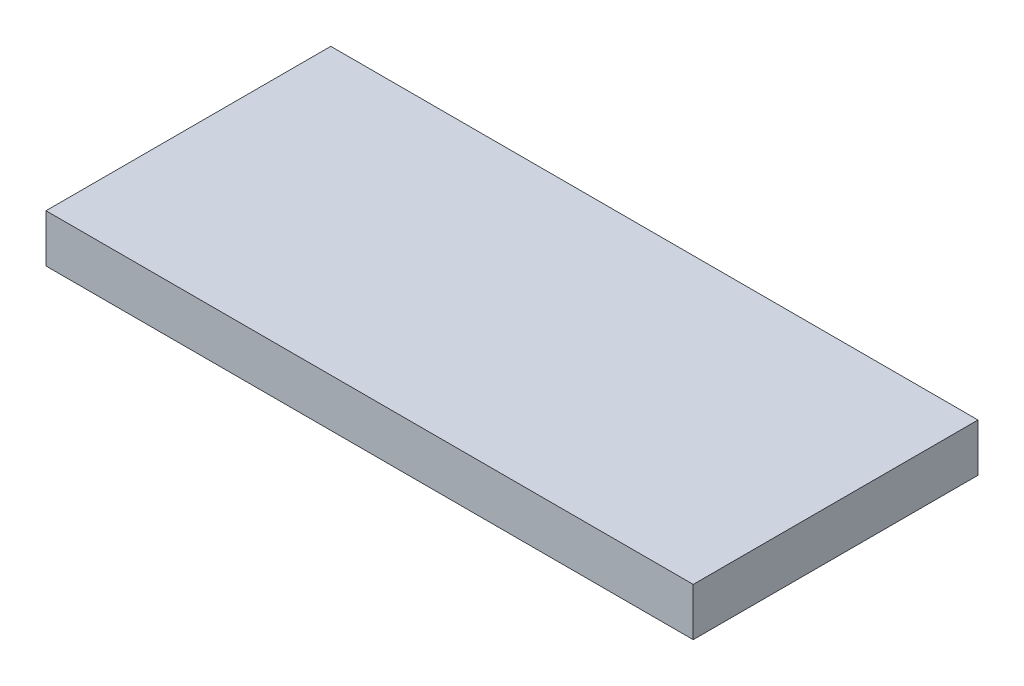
from build123d import *

# Parameters (mm, degrees)
BASE_OUTLINE_ADHESIVE_W  = 12.7
BASE_OUTLINE_ADHESIVE_H  = 0.9398
SELF_ADHESIVE_BASE_DEPTH = 2.794


with BuildPart() as part:
    # Base Outline Adhesive → Self Adhesive Base (new, symmetric)
    with BuildSketch(Plane.XY):
        with Locations((0, -0.4699)):
            Rectangle(BASE_OUTLINE_ADHESIVE_W, BASE_OUTLINE_ADHESIVE_H)
    extrude(amount=SELF_ADHESIVE_BASE_DEPTH, both=True)


solid = part.part
